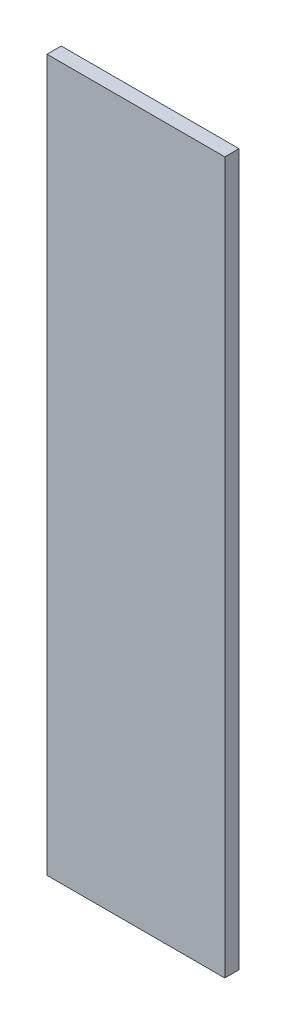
from build123d import *

# Parameters (mm, degrees)
SKETCH1_W      = 25
SKETCH1_H      = 100
EXTRUDE1_DEPTH = 2


with BuildPart() as part:
    # Sketch1 → Extrude1 (new body)
    with BuildSketch(Plane.XY):
        with Locations((-192.033444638, -31.483252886)):
            Rectangle(SKETCH1_W, SKETCH1_H)
    extrude(amount=EXTRUDE1_DEPTH)


solid = part.part
